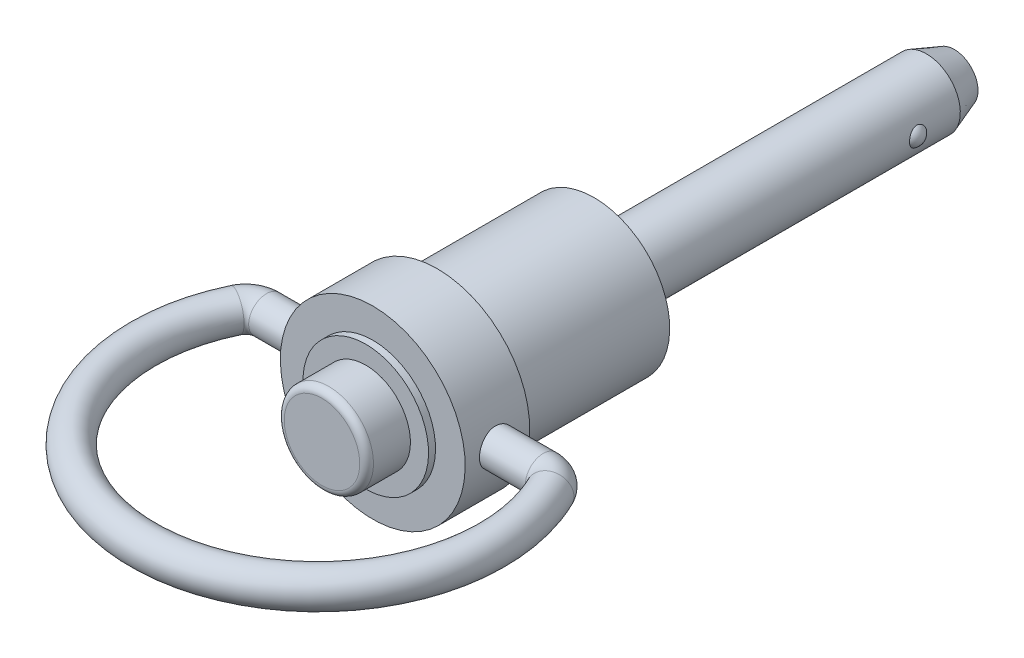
ISO-10303-21;
HEADER;
FILE_DESCRIPTION(('STEP AP214'),'2;1');
FILE_NAME('part.step','',(''),(''),'','','');
FILE_SCHEMA(('AUTOMOTIVE_DESIGN { 1 0 10303 214 1 1 1 1 }'));
ENDSEC;
DATA;
#1=APPLICATION_CONTEXT('core data for automotive mechanical design processes');
#2=APPLICATION_PROTOCOL_DEFINITION('international standard','automotive_design',2000,#1);
#3=PRODUCT_CONTEXT('',#1,'mechanical');
#4=PRODUCT('Part','Part','',(#3));
#5=PRODUCT_RELATED_PRODUCT_CATEGORY('part','',(#4));
#6=PRODUCT_DEFINITION_FORMATION('','',#4);
#7=PRODUCT_DEFINITION_CONTEXT('part definition',#1,'design');
#8=PRODUCT_DEFINITION('design','',#6,#7);
#9=PRODUCT_DEFINITION_SHAPE('','',#8);
#10=(LENGTH_UNIT() NAMED_UNIT(*) SI_UNIT(.MILLI.,.METRE.));
#11=(NAMED_UNIT(*) PLANE_ANGLE_UNIT() SI_UNIT($,.RADIAN.));
#12=(NAMED_UNIT(*) SI_UNIT($,.STERADIAN.) SOLID_ANGLE_UNIT());
#13=UNCERTAINTY_MEASURE_WITH_UNIT(LENGTH_MEASURE(1.E-05),#10,'distance_accuracy_value','');
#14=(GEOMETRIC_REPRESENTATION_CONTEXT(3) GLOBAL_UNCERTAINTY_ASSIGNED_CONTEXT((#13)) GLOBAL_UNIT_ASSIGNED_CONTEXT((#10,
#11,#12)) REPRESENTATION_CONTEXT('',''));
#15=CARTESIAN_POINT('',(0.,0.,0.));
#16=DIRECTION('',(0.,0.,1.));
#17=DIRECTION('',(1.,0.,0.));
#18=AXIS2_PLACEMENT_3D('',#15,#16,#17);
#19=CARTESIAN_POINT('',(0.,0.,20.828));
#20=DIRECTION('',(0.,0.,-1.));
#21=DIRECTION('',(0.,1.,0.));
#22=AXIS2_PLACEMENT_3D('',#19,#20,#21);
#23=CYLINDRICAL_SURFACE('',#22,3.2512);
#24=CARTESIAN_POINT('',(0.,0.,16.637));
#25=DIRECTION('',(0.,0.,-1.));
#26=DIRECTION('',(0.,1.,0.));
#27=AXIS2_PLACEMENT_3D('',#24,#25,#26);
#28=CIRCLE('',#27,3.2512);
#29=CARTESIAN_POINT('',(0.,3.2512,16.637));
#30=VERTEX_POINT('',#29);
#31=EDGE_CURVE('E34',#30,#30,#28,.T.);
#32=ORIENTED_EDGE('',*,*,#31,.F.);
#33=EDGE_LOOP('',(#32));
#34=FACE_BOUND('',#33,.T.);
#35=CARTESIAN_POINT('',(0.,0.,19.328));
#36=DIRECTION('',(0.,0.,1.));
#37=DIRECTION('',(1.,0.,0.));
#38=AXIS2_PLACEMENT_3D('',#35,#36,#37);
#39=CIRCLE('',#38,3.2512);
#40=CARTESIAN_POINT('',(3.2512,0.,19.328));
#41=VERTEX_POINT('',#40);
#42=EDGE_CURVE('E156',#41,#41,#39,.T.);
#43=ORIENTED_EDGE('',*,*,#42,.F.);
#44=EDGE_LOOP('',(#43));
#45=FACE_BOUND('',#44,.T.);
#46=ADVANCED_FACE('F12',(#34,#45),#23,.T.);
#47=CARTESIAN_POINT('',(4.572,0.,16.637));
#48=DIRECTION('',(0.,0.,1.));
#49=DIRECTION('',(0.,-1.,0.));
#50=AXIS2_PLACEMENT_3D('',#47,#48,#49);
#51=PLANE('',#50);
#52=ORIENTED_EDGE('',*,*,#31,.T.);
#53=EDGE_LOOP('',(#52));
#54=FACE_BOUND('',#53,.T.);
#55=CARTESIAN_POINT('',(0.,0.,16.637));
#56=DIRECTION('',(0.,0.,-1.));
#57=DIRECTION('',(0.,1.,0.));
#58=AXIS2_PLACEMENT_3D('',#55,#56,#57);
#59=CIRCLE('',#58,4.572);
#60=CARTESIAN_POINT('',(0.,4.572,16.637));
#61=VERTEX_POINT('',#60);
#62=EDGE_CURVE('E39',#61,#61,#59,.T.);
#63=ORIENTED_EDGE('',*,*,#62,.F.);
#64=EDGE_LOOP('',(#63));
#65=FACE_BOUND('',#64,.T.);
#66=ADVANCED_FACE('F80',(#54,#65),#51,.T.);
#67=CARTESIAN_POINT('',(0.,0.,0.));
#68=DIRECTION('',(0.,0.,-1.));
#69=DIRECTION('',(0.,1.,0.));
#70=AXIS2_PLACEMENT_3D('',#67,#68,#69);
#71=CYLINDRICAL_SURFACE('',#70,4.572);
#72=ORIENTED_EDGE('',*,*,#62,.T.);
#73=EDGE_LOOP('',(#72));
#74=FACE_BOUND('',#73,.T.);
#75=CARTESIAN_POINT('',(0.,0.,16.129));
#76=DIRECTION('',(0.,0.,-1.));
#77=DIRECTION('',(0.,1.,0.));
#78=AXIS2_PLACEMENT_3D('',#75,#76,#77);
#79=CIRCLE('',#78,4.572);
#80=CARTESIAN_POINT('',(0.,4.572,16.129));
#81=VERTEX_POINT('',#80);
#82=EDGE_CURVE('E42',#81,#81,#79,.T.);
#83=ORIENTED_EDGE('',*,*,#82,.F.);
#84=EDGE_LOOP('',(#83));
#85=FACE_BOUND('',#84,.T.);
#86=ADVANCED_FACE('F150',(#74,#85),#71,.T.);
#87=CARTESIAN_POINT('',(6.731,0.,16.129));
#88=DIRECTION('',(0.,0.,1.));
#89=DIRECTION('',(0.,-1.,0.));
#90=AXIS2_PLACEMENT_3D('',#87,#88,#89);
#91=PLANE('',#90);
#92=CARTESIAN_POINT('',(0.,0.,16.129));
#93=DIRECTION('',(0.,0.,-1.));
#94=DIRECTION('',(0.,1.,0.));
#95=AXIS2_PLACEMENT_3D('',#92,#93,#94);
#96=CIRCLE('',#95,6.731);
#97=CARTESIAN_POINT('',(0.,6.731,16.129));
#98=VERTEX_POINT('',#97);
#99=EDGE_CURVE('E45',#98,#98,#96,.T.);
#100=ORIENTED_EDGE('',*,*,#99,.F.);
#101=EDGE_LOOP('',(#100));
#102=FACE_BOUND('',#101,.T.);
#103=ORIENTED_EDGE('',*,*,#82,.T.);
#104=EDGE_LOOP('',(#103));
#105=FACE_BOUND('',#104,.T.);
#106=ADVANCED_FACE('F193',(#102,#105),#91,.T.);
#107=CARTESIAN_POINT('',(0.,0.,0.));
#108=DIRECTION('',(0.,0.,-1.));
#109=DIRECTION('',(0.,1.,0.));
#110=AXIS2_PLACEMENT_3D('',#107,#108,#109);
#111=CYLINDRICAL_SURFACE('',#110,6.731);
#112=CARTESIAN_POINT('',(0.,0.,11.43));
#113=DIRECTION('',(0.,0.,-1.));
#114=DIRECTION('',(0.,1.,0.));
#115=AXIS2_PLACEMENT_3D('',#112,#113,#114);
#116=CIRCLE('',#115,6.731);
#117=CARTESIAN_POINT('',(0.,6.731,11.43));
#118=VERTEX_POINT('',#117);
#119=EDGE_CURVE('E33',#118,#118,#116,.T.);
#120=ORIENTED_EDGE('',*,*,#119,.F.);
#121=EDGE_LOOP('',(#120));
#122=FACE_BOUND('',#121,.T.);
#123=ORIENTED_EDGE('',*,*,#99,.T.);
#124=EDGE_LOOP('',(#123));
#125=FACE_BOUND('',#124,.T.);
#126=CARTESIAN_POINT('',(-6.6051722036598,1.2954,13.7922));
#127=CARTESIAN_POINT('',(-6.60517361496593,1.2953972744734,13.864236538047));
#128=CARTESIAN_POINT('',(-6.60636346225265,1.28937073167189,13.9363080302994));
#129=CARTESIAN_POINT('',(-6.61098794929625,1.26544153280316,14.0784162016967));
#130=CARTESIAN_POINT('',(-6.61442445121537,1.24752902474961,14.1484511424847));
#131=CARTESIAN_POINT('',(-6.62313895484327,1.20040052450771,14.2844095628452));
#132=CARTESIAN_POINT('',(-6.62841519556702,1.17119533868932,14.3503369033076));
#133=CARTESIAN_POINT('',(-6.64021258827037,1.10233951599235,14.4763528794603));
#134=CARTESIAN_POINT('',(-6.64673365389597,1.06268960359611,14.5364419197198));
#135=CARTESIAN_POINT('',(-6.66038139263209,0.973516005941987,14.6498669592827));
#136=CARTESIAN_POINT('',(-6.66751428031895,0.9238817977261,14.7031153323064));
#137=CARTESIAN_POINT('',(-6.68152715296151,0.816387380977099,14.8005834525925));
#138=CARTESIAN_POINT('',(-6.6884071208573,0.758526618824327,14.8448025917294));
#139=CARTESIAN_POINT('',(-6.7012057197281,0.635644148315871,14.9232944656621));
#140=CARTESIAN_POINT('',(-6.70711617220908,0.570568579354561,14.9574843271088));
#141=CARTESIAN_POINT('',(-6.71724013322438,0.435464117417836,15.014412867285));
#142=CARTESIAN_POINT('',(-6.72145378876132,0.365435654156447,15.0371525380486));
#143=CARTESIAN_POINT('',(-6.72766549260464,0.223321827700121,15.0702635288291));
#144=CARTESIAN_POINT('',(-6.72968999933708,0.151272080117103,15.0807826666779));
#145=CARTESIAN_POINT('',(-6.73138656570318,0.00640388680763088,15.089614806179));
#146=CARTESIAN_POINT('',(-6.73105883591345,-0.0664144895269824,15.0879289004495));
#147=CARTESIAN_POINT('',(-6.72810846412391,-0.209738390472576,15.072511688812));
#148=CARTESIAN_POINT('',(-6.72551615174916,-0.280261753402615,15.0589395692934));
#149=CARTESIAN_POINT('',(-6.71836197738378,-0.418011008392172,15.0203872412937));
#150=CARTESIAN_POINT('',(-6.71380004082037,-0.485236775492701,14.9954066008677));
#151=CARTESIAN_POINT('',(-6.70316878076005,-0.614941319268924,14.9345963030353));
#152=CARTESIAN_POINT('',(-6.69709072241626,-0.67738974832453,14.8987035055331));
#153=CARTESIAN_POINT('',(-6.68409856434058,-0.795436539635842,14.8171343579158));
#154=CARTESIAN_POINT('',(-6.677184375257,-0.851034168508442,14.7714569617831));
#155=CARTESIAN_POINT('',(-6.66315320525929,-0.954744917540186,14.6707395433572));
#156=CARTESIAN_POINT('',(-6.65603475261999,-1.00272266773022,14.6155602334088));
#157=CARTESIAN_POINT('',(-6.64250376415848,-1.08876420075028,14.4978679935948));
#158=CARTESIAN_POINT('',(-6.63609123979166,-1.12682782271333,14.4353549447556));
#159=CARTESIAN_POINT('',(-6.62469571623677,-1.19200234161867,14.3045844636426));
#160=CARTESIAN_POINT('',(-6.61971540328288,-1.21909269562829,14.2363165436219));
#161=CARTESIAN_POINT('',(-6.61178862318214,-1.26138008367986,14.0960804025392));
#162=CARTESIAN_POINT('',(-6.60884191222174,-1.27657854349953,14.0241126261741));
#163=CARTESIAN_POINT('',(-6.60536444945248,-1.29445125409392,13.8797427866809));
#164=CARTESIAN_POINT('',(-6.60479610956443,-1.29732037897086,13.8073657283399));
#165=CARTESIAN_POINT('',(-6.60603903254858,-1.29097613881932,13.6631669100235));
#166=CARTESIAN_POINT('',(-6.60785017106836,-1.28176340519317,13.5913451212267));
#167=CARTESIAN_POINT('',(-6.6136128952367,-1.25168453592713,13.4509418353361));
#168=CARTESIAN_POINT('',(-6.61754556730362,-1.23092132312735,13.3823374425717));
#169=CARTESIAN_POINT('',(-6.62709183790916,-1.17844042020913,13.249581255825));
#170=CARTESIAN_POINT('',(-6.63270556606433,-1.14672188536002,13.1854298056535));
#171=CARTESIAN_POINT('',(-6.6450665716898,-1.07278507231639,13.0625442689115));
#172=CARTESIAN_POINT('',(-6.65182676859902,-1.03044414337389,13.0038853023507));
#173=CARTESIAN_POINT('',(-6.66568301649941,-0.936629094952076,12.8944341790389));
#174=CARTESIAN_POINT('',(-6.67277909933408,-0.885154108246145,12.8436427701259));
#175=CARTESIAN_POINT('',(-6.68662882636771,-0.773660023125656,12.7506362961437));
#176=CARTESIAN_POINT('',(-6.69337621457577,-0.713530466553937,12.7085525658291));
#177=CARTESIAN_POINT('',(-6.70566168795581,-0.586941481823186,12.6350847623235));
#178=CARTESIAN_POINT('',(-6.71119982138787,-0.520482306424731,12.6037002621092));
#179=CARTESIAN_POINT('',(-6.72041595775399,-0.383476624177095,12.5527164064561));
#180=CARTESIAN_POINT('',(-6.72410395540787,-0.312954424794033,12.5330536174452));
#181=CARTESIAN_POINT('',(-6.72924701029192,-0.169530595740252,12.5058694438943));
#182=CARTESIAN_POINT('',(-6.7307023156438,-0.0966292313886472,12.4983467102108));
#183=CARTESIAN_POINT('',(-6.73121071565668,0.0482259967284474,12.4957052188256));
#184=CARTESIAN_POINT('',(-6.73030215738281,0.120176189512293,12.5003884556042));
#185=CARTESIAN_POINT('',(-6.72626496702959,0.26224403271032,12.5215909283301));
#186=CARTESIAN_POINT('',(-6.72313635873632,0.332361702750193,12.5381100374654));
#187=CARTESIAN_POINT('',(-6.71501101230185,0.468662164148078,12.5824301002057));
#188=CARTESIAN_POINT('',(-6.710017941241,0.534852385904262,12.6102089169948));
#189=CARTESIAN_POINT('',(-6.69870305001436,0.661661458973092,12.6762356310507));
#190=CARTESIAN_POINT('',(-6.69238113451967,0.722279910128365,12.7144842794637));
#191=CARTESIAN_POINT('',(-6.6789853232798,0.837208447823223,12.8010411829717));
#192=CARTESIAN_POINT('',(-6.67190155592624,0.891410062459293,12.8494919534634));
#193=CARTESIAN_POINT('',(-6.65784127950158,0.990982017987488,12.95478313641));
#194=CARTESIAN_POINT('',(-6.65086479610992,1.03635027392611,13.0116255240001));
#195=CARTESIAN_POINT('',(-6.63773378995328,1.11738877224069,13.1327559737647));
#196=CARTESIAN_POINT('',(-6.63158802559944,1.15295925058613,13.1971117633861));
#197=CARTESIAN_POINT('',(-6.62092027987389,1.21272619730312,13.3309847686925));
#198=CARTESIAN_POINT('',(-6.61639678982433,1.23693323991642,13.4004971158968));
#199=CARTESIAN_POINT('',(-6.61041337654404,1.26845390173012,13.5238636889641));
#200=CARTESIAN_POINT('',(-6.60845980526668,1.27854107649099,13.57700269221));
#201=CARTESIAN_POINT('',(-6.60583870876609,1.29201504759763,13.6841545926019));
#202=CARTESIAN_POINT('',(-6.60517114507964,1.29540204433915,13.7381674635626));
#203=CARTESIAN_POINT('',(-6.6051722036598,1.2954,13.7922));
#204=B_SPLINE_CURVE_WITH_KNOTS('',3,(#126,#127,#128,#129,#130,#131,#132,#133,#134,#135,#136,
#137,#138,#139,#140,#141,#142,#143,#144,#145,#146,#147,#148,#149,#150,#151,#152,#153,#154,#155,
#156,#157,#158,#159,#160,#161,#162,#163,#164,#165,#166,#167,#168,#169,#170,#171,#172,#173,#174,
#175,#176,#177,#178,#179,#180,#181,#182,#183,#184,#185,#186,#187,#188,#189,#190,#191,#192,#193,
#194,#195,#196,#197,#198,#199,#200,#201,#202,#203),.UNSPECIFIED.,.T.,.F.,(4,2,2,2,2,2,2,2,2,2,2,
2,2,2,2,2,2,2,2,2,2,2,2,2,2,2,2,2,2,2,2,2,2,2,2,2,2,2,4),(0.,0.215911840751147,
0.432002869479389,0.64788762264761,0.86375740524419,1.08216318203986,1.30058366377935,
1.52076118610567,1.74091962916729,1.95838638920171,2.1758336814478,2.39041258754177,
2.60499961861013,2.82085272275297,3.0367289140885,3.25609136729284,3.47545737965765,
3.69523218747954,3.91498064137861,4.13124273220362,4.34749352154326,4.56184753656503,
4.7762180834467,4.99318797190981,5.21017847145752,5.430235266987,5.65028327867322,
5.86912939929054,6.08795119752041,6.30324544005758,6.51853737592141,6.73340808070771,
6.94829420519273,7.16640910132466,7.38457541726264,7.60488731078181,7.82499378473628,
7.9869478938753,8.14889715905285),.UNSPECIFIED.);
#205=CARTESIAN_POINT('',(-6.6051722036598,1.2954,13.7922));
#206=VERTEX_POINT('',#205);
#207=EDGE_CURVE('E27',#206,#206,#204,.T.);
#208=ORIENTED_EDGE('',*,*,#207,.T.);
#209=EDGE_LOOP('',(#208));
#210=FACE_BOUND('',#209,.T.);
#211=CARTESIAN_POINT('',(6.6051722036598,1.2954,13.7922));
#212=CARTESIAN_POINT('',(6.60517361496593,1.2953972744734,13.720163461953));
#213=CARTESIAN_POINT('',(6.60636346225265,1.2893707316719,13.6480919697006));
#214=CARTESIAN_POINT('',(6.61098794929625,1.26544153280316,13.5059837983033));
#215=CARTESIAN_POINT('',(6.61442445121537,1.24752902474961,13.4359488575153));
#216=CARTESIAN_POINT('',(6.62313895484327,1.20040052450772,13.2999904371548));
#217=CARTESIAN_POINT('',(6.62841519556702,1.17119533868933,13.2340630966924));
#218=CARTESIAN_POINT('',(6.64021258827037,1.10233951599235,13.1080471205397));
#219=CARTESIAN_POINT('',(6.64673365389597,1.06268960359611,13.0479580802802));
#220=CARTESIAN_POINT('',(6.66038139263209,0.973516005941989,12.9345330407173));
#221=CARTESIAN_POINT('',(6.66751428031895,0.923881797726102,12.8812846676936));
#222=CARTESIAN_POINT('',(6.68152715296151,0.816387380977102,12.7838165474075));
#223=CARTESIAN_POINT('',(6.6884071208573,0.758526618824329,12.7395974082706));
#224=CARTESIAN_POINT('',(6.7012057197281,0.635644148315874,12.6611055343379));
#225=CARTESIAN_POINT('',(6.70711617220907,0.570568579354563,12.6269156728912));
#226=CARTESIAN_POINT('',(6.71724013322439,0.435464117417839,12.569987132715));
#227=CARTESIAN_POINT('',(6.72145378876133,0.36543565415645,12.5472474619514));
#228=CARTESIAN_POINT('',(6.72766549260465,0.223321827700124,12.5141364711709));
#229=CARTESIAN_POINT('',(6.72968999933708,0.151272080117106,12.5036173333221));
#230=CARTESIAN_POINT('',(6.73138656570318,0.00640388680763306,12.494785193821));
#231=CARTESIAN_POINT('',(6.73105883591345,-0.0664144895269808,12.4964710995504));
#232=CARTESIAN_POINT('',(6.72810846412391,-0.209738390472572,12.511888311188));
#233=CARTESIAN_POINT('',(6.72551615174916,-0.280261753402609,12.5254604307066));
#234=CARTESIAN_POINT('',(6.71836197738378,-0.418011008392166,12.5640127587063));
#235=CARTESIAN_POINT('',(6.71380004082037,-0.4852367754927,12.5889933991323));
#236=CARTESIAN_POINT('',(6.70316878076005,-0.614941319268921,12.6498036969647));
#237=CARTESIAN_POINT('',(6.69709072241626,-0.67738974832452,12.6856964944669));
#238=CARTESIAN_POINT('',(6.68409856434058,-0.795436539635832,12.7672656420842));
#239=CARTESIAN_POINT('',(6.677184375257,-0.851034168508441,12.8129430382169));
#240=CARTESIAN_POINT('',(6.66315320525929,-0.954744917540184,12.9136604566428));
#241=CARTESIAN_POINT('',(6.65603475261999,-1.00272266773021,12.9688397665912));
#242=CARTESIAN_POINT('',(6.64250376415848,-1.08876420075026,13.0865320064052));
#243=CARTESIAN_POINT('',(6.63609123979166,-1.12682782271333,13.1490450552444));
#244=CARTESIAN_POINT('',(6.62469571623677,-1.19200234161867,13.2798155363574));
#245=CARTESIAN_POINT('',(6.61971540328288,-1.21909269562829,13.3480834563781));
#246=CARTESIAN_POINT('',(6.61178862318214,-1.26138008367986,13.4883195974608));
#247=CARTESIAN_POINT('',(6.60884191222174,-1.27657854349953,13.5602873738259));
#248=CARTESIAN_POINT('',(6.60536444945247,-1.29445125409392,13.7046572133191));
#249=CARTESIAN_POINT('',(6.60479610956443,-1.29732037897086,13.7770342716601));
#250=CARTESIAN_POINT('',(6.60603903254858,-1.29097613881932,13.9212330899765));
#251=CARTESIAN_POINT('',(6.60785017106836,-1.28176340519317,13.9930548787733));
#252=CARTESIAN_POINT('',(6.6136128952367,-1.25168453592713,14.1334581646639));
#253=CARTESIAN_POINT('',(6.61754556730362,-1.23092132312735,14.2020625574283));
#254=CARTESIAN_POINT('',(6.62709183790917,-1.17844042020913,14.334818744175));
#255=CARTESIAN_POINT('',(6.63270556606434,-1.14672188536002,14.3989701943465));
#256=CARTESIAN_POINT('',(6.64506657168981,-1.07278507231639,14.5218557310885));
#257=CARTESIAN_POINT('',(6.65182676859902,-1.03044414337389,14.5805146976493));
#258=CARTESIAN_POINT('',(6.66568301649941,-0.936629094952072,14.6899658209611));
#259=CARTESIAN_POINT('',(6.67277909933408,-0.885154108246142,14.7407572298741));
#260=CARTESIAN_POINT('',(6.68662882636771,-0.773660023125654,14.8337637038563));
#261=CARTESIAN_POINT('',(6.69337621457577,-0.713530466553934,14.8758474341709));
#262=CARTESIAN_POINT('',(6.70566168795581,-0.586941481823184,14.9493152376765));
#263=CARTESIAN_POINT('',(6.71119982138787,-0.520482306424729,14.9806997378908));
#264=CARTESIAN_POINT('',(6.72041595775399,-0.383476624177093,15.0316835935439));
#265=CARTESIAN_POINT('',(6.72410395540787,-0.31295442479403,15.0513463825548));
#266=CARTESIAN_POINT('',(6.72924701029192,-0.169530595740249,15.0785305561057));
#267=CARTESIAN_POINT('',(6.7307023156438,-0.0966292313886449,15.0860532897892));
#268=CARTESIAN_POINT('',(6.73121071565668,0.0482259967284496,15.0886947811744));
#269=CARTESIAN_POINT('',(6.73030215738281,0.120176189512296,15.0840115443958));
#270=CARTESIAN_POINT('',(6.72626496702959,0.262244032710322,15.0628090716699));
#271=CARTESIAN_POINT('',(6.72313635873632,0.332361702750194,15.0462899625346));
#272=CARTESIAN_POINT('',(6.71501101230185,0.46866216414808,15.0019698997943));
#273=CARTESIAN_POINT('',(6.710017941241,0.534852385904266,14.9741910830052));
#274=CARTESIAN_POINT('',(6.69870305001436,0.661661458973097,14.9081643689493));
#275=CARTESIAN_POINT('',(6.69238113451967,0.722279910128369,14.8699157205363));
#276=CARTESIAN_POINT('',(6.6789853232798,0.837208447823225,14.7833588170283));
#277=CARTESIAN_POINT('',(6.67190155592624,0.891410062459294,14.7349080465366));
#278=CARTESIAN_POINT('',(6.65784127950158,0.990982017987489,14.62961686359));
#279=CARTESIAN_POINT('',(6.65086479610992,1.03635027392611,14.5727744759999));
#280=CARTESIAN_POINT('',(6.63773378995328,1.1173887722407,14.4516440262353));
#281=CARTESIAN_POINT('',(6.63158802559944,1.15295925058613,14.3872882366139));
#282=CARTESIAN_POINT('',(6.62092027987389,1.21272619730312,14.2534152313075));
#283=CARTESIAN_POINT('',(6.61639678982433,1.23693323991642,14.1839028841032));
#284=CARTESIAN_POINT('',(6.61041337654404,1.26845390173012,14.0605363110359));
#285=CARTESIAN_POINT('',(6.60845980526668,1.27854107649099,14.00739730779));
#286=CARTESIAN_POINT('',(6.60583870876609,1.29201504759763,13.9002454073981));
#287=CARTESIAN_POINT('',(6.60517114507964,1.29540204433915,13.8462325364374));
#288=CARTESIAN_POINT('',(6.6051722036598,1.2954,13.7922));
#289=B_SPLINE_CURVE_WITH_KNOTS('',3,(#211,#212,#213,#214,#215,#216,#217,#218,#219,#220,#221,
#222,#223,#224,#225,#226,#227,#228,#229,#230,#231,#232,#233,#234,#235,#236,#237,#238,#239,#240,
#241,#242,#243,#244,#245,#246,#247,#248,#249,#250,#251,#252,#253,#254,#255,#256,#257,#258,#259,
#260,#261,#262,#263,#264,#265,#266,#267,#268,#269,#270,#271,#272,#273,#274,#275,#276,#277,#278,
#279,#280,#281,#282,#283,#284,#285,#286,#287,#288),.UNSPECIFIED.,.T.,.F.,(4,2,2,2,2,2,2,2,2,2,2,
2,2,2,2,2,2,2,2,2,2,2,2,2,2,2,2,2,2,2,2,2,2,2,2,2,2,2,4),(0.,0.215911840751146,
0.432002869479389,0.64788762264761,0.86375740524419,1.08216318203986,1.30058366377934,
1.52076118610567,1.74091962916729,1.95838638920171,2.1758336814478,2.39041258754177,
2.60499961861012,2.82085272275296,3.0367289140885,3.25609136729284,3.47545737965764,
3.69523218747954,3.91498064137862,4.13124273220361,4.34749352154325,4.56184753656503,
4.77621808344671,4.99318797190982,5.21017847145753,5.43023526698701,5.65028327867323,
5.86912939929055,6.08795119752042,6.30324544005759,6.51853737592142,6.73340808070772,
6.94829420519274,7.16640910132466,7.38457541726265,7.60488731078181,7.82499378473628,
7.98694789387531,8.14889715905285),.UNSPECIFIED.);
#290=CARTESIAN_POINT('',(6.6051722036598,1.2954,13.7922));
#291=VERTEX_POINT('',#290);
#292=EDGE_CURVE('E23',#291,#291,#289,.T.);
#293=ORIENTED_EDGE('',*,*,#292,.T.);
#294=EDGE_LOOP('',(#293));
#295=FACE_BOUND('',#294,.T.);
#296=ADVANCED_FACE('F142',(#122,#125,#210,#295),#111,.T.);
#297=CARTESIAN_POINT('',(5.7785,0.,11.43));
#298=DIRECTION('',(0.,0.,-1.));
#299=DIRECTION('',(0.,1.,0.));
#300=AXIS2_PLACEMENT_3D('',#297,#298,#299);
#301=PLANE('',#300);
#302=CARTESIAN_POINT('',(0.,0.,11.43));
#303=DIRECTION('',(0.,0.,-1.));
#304=DIRECTION('',(0.,1.,0.));
#305=AXIS2_PLACEMENT_3D('',#302,#303,#304);
#306=CIRCLE('',#305,5.9);
#307=CARTESIAN_POINT('',(0.,5.9,11.43));
#308=VERTEX_POINT('',#307);
#309=EDGE_CURVE('E19',#308,#308,#306,.F.);
#310=ORIENTED_EDGE('',*,*,#309,.T.);
#311=EDGE_LOOP('',(#310));
#312=FACE_BOUND('',#311,.T.);
#313=ORIENTED_EDGE('',*,*,#119,.T.);
#314=EDGE_LOOP('',(#313));
#315=FACE_BOUND('',#314,.T.);
#316=ADVANCED_FACE('F136',(#312,#315),#301,.T.);
#317=CARTESIAN_POINT('',(10.0803124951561,0.,15.3162));
#318=DIRECTION('',(0.,1.,0.));
#319=DIRECTION('',(-1.,0.,0.));
#320=AXIS2_PLACEMENT_3D('',#317,#318,#319);
#321=TOROIDAL_SURFACE('',#320,1.524,1.2954);
#322=CARTESIAN_POINT('',(11.4549005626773,0.,14.658109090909));
#323=DIRECTION('',(-0.431818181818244,0.,-0.901960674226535));
#324=DIRECTION('',(0.901960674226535,0.,-0.431818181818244));
#325=AXIS2_PLACEMENT_3D('',#322,#323,#324);
#326=CIRCLE('',#325,1.2954);
#327=CARTESIAN_POINT('',(12.6233004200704,0.,14.0987318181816));
#328=VERTEX_POINT('',#327);
#329=EDGE_CURVE('E50',#328,#328,#326,.T.);
#330=ORIENTED_EDGE('',*,*,#329,.T.);
#331=EDGE_LOOP('',(#330));
#332=FACE_BOUND('',#331,.T.);
#333=CARTESIAN_POINT('',(10.0803124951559,0.,13.7922));
#334=DIRECTION('',(1.,0.,0.));
#335=DIRECTION('',(0.,1.,0.));
#336=AXIS2_PLACEMENT_3D('',#333,#334,#335);
#337=CIRCLE('',#336,1.2954);
#338=CARTESIAN_POINT('',(10.0803124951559,1.2954,13.7922));
#339=VERTEX_POINT('',#338);
#340=EDGE_CURVE('E38',#339,#339,#337,.F.);
#341=ORIENTED_EDGE('',*,*,#340,.F.);
#342=EDGE_LOOP('',(#341));
#343=FACE_BOUND('',#342,.T.);
#344=ADVANCED_FACE('F78',(#332,#343),#321,.T.);
#345=CARTESIAN_POINT('',(-10.0803124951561,0.,13.7922));
#346=DIRECTION('',(1.,0.,0.));
#347=DIRECTION('',(0.,1.,0.));
#348=AXIS2_PLACEMENT_3D('',#345,#346,#347);
#349=CYLINDRICAL_SURFACE('',#348,1.2954);
#350=ORIENTED_EDGE('',*,*,#292,.F.);
#351=EDGE_LOOP('',(#350));
#352=FACE_BOUND('',#351,.T.);
#353=ORIENTED_EDGE('',*,*,#340,.T.);
#354=EDGE_LOOP('',(#353));
#355=FACE_BOUND('',#354,.T.);
#356=ADVANCED_FACE('F74',(#352,#355),#349,.T.);
#357=CARTESIAN_POINT('',(0.,0.,20.1422));
#358=DIRECTION('',(0.,1.,0.));
#359=DIRECTION('',(-1.,0.,0.));
#360=AXIS2_PLACEMENT_3D('',#357,#358,#359);
#361=TOROIDAL_SURFACE('',#360,12.7,1.2954);
#362=CARTESIAN_POINT('',(-11.4549005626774,0.,14.6581090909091));
#363=DIRECTION('',(-0.43181818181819,0.,0.901960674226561));
#364=DIRECTION('',(-0.901960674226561,0.,-0.43181818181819));
#365=AXIS2_PLACEMENT_3D('',#362,#363,#364);
#366=CIRCLE('',#365,1.2954);
#367=CARTESIAN_POINT('',(-12.6233004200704,0.,14.0987318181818));
#368=VERTEX_POINT('',#367);
#369=EDGE_CURVE('E53',#368,#368,#366,.F.);
#370=ORIENTED_EDGE('',*,*,#369,.F.);
#371=EDGE_LOOP('',(#370));
#372=FACE_BOUND('',#371,.T.);
#373=ORIENTED_EDGE('',*,*,#329,.F.);
#374=EDGE_LOOP('',(#373));
#375=FACE_BOUND('',#374,.T.);
#376=ADVANCED_FACE('F71',(#372,#375),#361,.T.);
#377=CARTESIAN_POINT('',(-10.0803124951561,0.,15.3162));
#378=DIRECTION('',(0.,1.,0.));
#379=DIRECTION('',(-1.,0.,0.));
#380=AXIS2_PLACEMENT_3D('',#377,#378,#379);
#381=TOROIDAL_SURFACE('',#380,1.524,1.2954);
#382=CARTESIAN_POINT('',(-10.0803124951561,0.,13.7922));
#383=DIRECTION('',(1.,0.,0.));
#384=DIRECTION('',(0.,1.,0.));
#385=AXIS2_PLACEMENT_3D('',#382,#383,#384);
#386=CIRCLE('',#385,1.2954);
#387=CARTESIAN_POINT('',(-10.0803124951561,1.2954,13.7922));
#388=VERTEX_POINT('',#387);
#389=EDGE_CURVE('E37',#388,#388,#386,.T.);
#390=ORIENTED_EDGE('',*,*,#389,.F.);
#391=EDGE_LOOP('',(#390));
#392=FACE_BOUND('',#391,.T.);
#393=ORIENTED_EDGE('',*,*,#369,.T.);
#394=EDGE_LOOP('',(#393));
#395=FACE_BOUND('',#394,.T.);
#396=ADVANCED_FACE('F66',(#392,#395),#381,.T.);
#397=CARTESIAN_POINT('',(-10.0803124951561,0.,13.7922));
#398=DIRECTION('',(1.,0.,0.));
#399=DIRECTION('',(0.,1.,0.));
#400=AXIS2_PLACEMENT_3D('',#397,#398,#399);
#401=CYLINDRICAL_SURFACE('',#400,1.2954);
#402=ORIENTED_EDGE('',*,*,#207,.F.);
#403=EDGE_LOOP('',(#402));
#404=FACE_BOUND('',#403,.T.);
#405=ORIENTED_EDGE('',*,*,#389,.T.);
#406=EDGE_LOOP('',(#405));
#407=FACE_BOUND('',#406,.T.);
#408=ADVANCED_FACE('F70',(#404,#407),#401,.T.);
#409=CARTESIAN_POINT('',(0.,0.,19.328));
#410=DIRECTION('',(0.,0.,1.));
#411=DIRECTION('',(1.,0.,0.));
#412=AXIS2_PLACEMENT_3D('',#409,#410,#411);
#413=TOROIDAL_SURFACE('',#412,2.7512,0.5);
#414=CARTESIAN_POINT('',(0.,0.,19.828));
#415=DIRECTION('',(0.,0.,1.));
#416=DIRECTION('',(1.,0.,0.));
#417=AXIS2_PLACEMENT_3D('',#414,#415,#416);
#418=CIRCLE('',#417,2.7512);
#419=CARTESIAN_POINT('',(2.7512,0.,19.828));
#420=VERTEX_POINT('',#419);
#421=EDGE_CURVE('E158',#420,#420,#418,.T.);
#422=ORIENTED_EDGE('',*,*,#421,.F.);
#423=EDGE_LOOP('',(#422));
#424=FACE_BOUND('',#423,.T.);
#425=ORIENTED_EDGE('',*,*,#42,.T.);
#426=EDGE_LOOP('',(#425));
#427=FACE_BOUND('',#426,.T.);
#428=ADVANCED_FACE('F97',(#424,#427),#413,.T.);
#429=CARTESIAN_POINT('',(0.,0.,19.828));
#430=DIRECTION('',(0.,0.,-1.));
#431=DIRECTION('',(-1.,0.,0.));
#432=AXIS2_PLACEMENT_3D('',#429,#430,#431);
#433=PLANE('',#432);
#434=ORIENTED_EDGE('',*,*,#421,.T.);
#435=EDGE_LOOP('',(#434));
#436=FACE_BOUND('',#435,.T.);
#437=ADVANCED_FACE('F170',(#436),#433,.F.);
#438=CARTESIAN_POINT('',(0.,0.,42.1857590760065));
#439=DIRECTION('',(0.,0.,-1.));
#440=DIRECTION('',(0.,1.,0.));
#441=AXIS2_PLACEMENT_3D('',#438,#439,#440);
#442=CYLINDRICAL_SURFACE('',#441,5.5);
#443=CARTESIAN_POINT('',(0.,0.,11.03));
#444=DIRECTION('',(0.,0.,-1.));
#445=DIRECTION('',(0.,1.,0.));
#446=AXIS2_PLACEMENT_3D('',#443,#444,#445);
#447=CIRCLE('',#446,5.5);
#448=CARTESIAN_POINT('',(0.,5.5,11.03));
#449=VERTEX_POINT('',#448);
#450=EDGE_CURVE('E8',#449,#449,#447,.T.);
#451=ORIENTED_EDGE('',*,*,#450,.T.);
#452=EDGE_LOOP('',(#451));
#453=FACE_BOUND('',#452,.T.);
#454=CARTESIAN_POINT('',(0.,0.,0.));
#455=DIRECTION('',(0.,0.,-1.));
#456=DIRECTION('',(0.,1.,0.));
#457=AXIS2_PLACEMENT_3D('',#454,#455,#456);
#458=CIRCLE('',#457,5.5);
#459=CARTESIAN_POINT('',(0.,5.5,0.));
#460=VERTEX_POINT('',#459);
#461=EDGE_CURVE('E161',#460,#460,#458,.T.);
#462=ORIENTED_EDGE('',*,*,#461,.F.);
#463=EDGE_LOOP('',(#462));
#464=FACE_BOUND('',#463,.T.);
#465=ADVANCED_FACE('F104',(#453,#464),#442,.T.);
#466=CARTESIAN_POINT('',(1.73119748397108,0.,-26.2306));
#467=DIRECTION('',(0.,0.,1.));
#468=DIRECTION('',(0.,-1.,0.));
#469=AXIS2_PLACEMENT_3D('',#466,#467,#468);
#470=PLANE('',#469);
#471=CARTESIAN_POINT('',(0.,0.,-26.2306000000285));
#472=DIRECTION('',(0.,0.,1.));
#473=DIRECTION('',(-1.,0.,0.));
#474=AXIS2_PLACEMENT_3D('',#471,#472,#473);
#475=CIRCLE('',#474,1.73119748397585);
#476=CARTESIAN_POINT('',(-1.73119748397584,0.,-26.2306000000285));
#477=VERTEX_POINT('',#476);
#478=EDGE_CURVE('E123',#477,#477,#475,.T.);
#479=ORIENTED_EDGE('',*,*,#478,.F.);
#480=EDGE_LOOP('',(#479));
#481=FACE_BOUND('',#480,.T.);
#482=ADVANCED_FACE('F99',(#481),#470,.F.);
#483=CARTESIAN_POINT('',(1.97739,0.,-21.1252));
#484=DIRECTION('',(0.,0.,1.));
#485=DIRECTION('',(1.,0.,0.));
#486=AXIS2_PLACEMENT_3D('',#483,#484,#485);
#487=SPHERICAL_SURFACE('',#486,0.79375);
#488=CARTESIAN_POINT('',(2.470785,0.,-20.5034279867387));
#489=CARTESIAN_POINT('',(2.47078450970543,0.0407779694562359,-20.5034284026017));
#490=CARTESIAN_POINT('',(2.46976664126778,0.0815627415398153,-20.5066414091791));
#491=CARTESIAN_POINT('',(2.46579298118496,0.162087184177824,-20.5194782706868));
#492=CARTESIAN_POINT('',(2.46283382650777,0.20182491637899,-20.5291132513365));
#493=CARTESIAN_POINT('',(2.45527981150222,0.279082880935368,-20.5547224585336));
#494=CARTESIAN_POINT('',(2.45068366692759,0.316601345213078,-20.5707016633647));
#495=CARTESIAN_POINT('',(2.44036557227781,0.38820458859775,-20.6088086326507));
#496=CARTESIAN_POINT('',(2.43464406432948,0.422290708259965,-20.6309339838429));
#497=CARTESIAN_POINT('',(2.42293774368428,0.484910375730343,-20.6802681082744));
#498=CARTESIAN_POINT('',(2.41696529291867,0.513575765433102,-20.7073117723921));
#499=CARTESIAN_POINT('',(2.40537490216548,0.56538165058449,-20.7663344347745));
#500=CARTESIAN_POINT('',(2.39975676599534,0.588525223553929,-20.7983106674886));
#501=CARTESIAN_POINT('',(2.39013715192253,0.626395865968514,-20.8632598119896));
#502=CARTESIAN_POINT('',(2.38603581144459,0.641692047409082,-20.8958854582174));
#503=CARTESIAN_POINT('',(2.37935105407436,0.666054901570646,-20.9635277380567));
#504=CARTESIAN_POINT('',(2.37676637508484,0.675126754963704,-20.9985423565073));
#505=CARTESIAN_POINT('',(2.37365169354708,0.685991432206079,-21.0661524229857));
#506=CARTESIAN_POINT('',(2.37294150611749,0.688423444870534,-21.0986379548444));
#507=CARTESIAN_POINT('',(2.37313557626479,0.687754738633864,-21.1635427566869));
#508=CARTESIAN_POINT('',(2.37403937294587,0.684655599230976,-21.1959620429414));
#509=CARTESIAN_POINT('',(2.37727684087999,0.673323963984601,-21.258349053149));
#510=CARTESIAN_POINT('',(2.37954686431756,0.665319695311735,-21.2883621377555));
#511=CARTESIAN_POINT('',(2.38521427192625,0.644705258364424,-21.3466434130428));
#512=CARTESIAN_POINT('',(2.38861178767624,0.632094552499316,-21.374911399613));
#513=CARTESIAN_POINT('',(2.39633342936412,0.602171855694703,-21.4300782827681));
#514=CARTESIAN_POINT('',(2.40068724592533,0.584702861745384,-21.4568875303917));
#515=CARTESIAN_POINT('',(2.40981924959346,0.545846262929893,-21.5074782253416));
#516=CARTESIAN_POINT('',(2.41459823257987,0.52445122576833,-21.5312537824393));
#517=CARTESIAN_POINT('',(2.42457469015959,0.476310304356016,-21.5773361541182));
#518=CARTESIAN_POINT('',(2.42977140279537,0.449257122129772,-21.5993219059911));
#519=CARTESIAN_POINT('',(2.43965148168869,0.392072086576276,-21.6388785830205));
#520=CARTESIAN_POINT('',(2.44433535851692,0.361943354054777,-21.6564539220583));
#521=CARTESIAN_POINT('',(2.45319212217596,0.296347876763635,-21.6884994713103));
#522=CARTESIAN_POINT('',(2.45727382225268,0.260646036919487,-21.7025143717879));
#523=CARTESIAN_POINT('',(2.4639385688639,0.187441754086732,-21.7249081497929));
#524=CARTESIAN_POINT('',(2.46652349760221,0.149941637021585,-21.7332941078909));
#525=CARTESIAN_POINT('',(2.46992655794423,0.0749487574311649,-21.7442592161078));
#526=CARTESIAN_POINT('',(2.47078545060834,0.0374772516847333,-21.7469723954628));
#527=CARTESIAN_POINT('',(2.47078450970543,-0.0407779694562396,-21.7469715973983));
#528=CARTESIAN_POINT('',(2.46976664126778,-0.0815627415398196,-21.7437585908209));
#529=CARTESIAN_POINT('',(2.46579298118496,-0.16208718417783,-21.7309217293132));
#530=CARTESIAN_POINT('',(2.46283382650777,-0.201824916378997,-21.7212867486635));
#531=CARTESIAN_POINT('',(2.45527981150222,-0.279082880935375,-21.6956775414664));
#532=CARTESIAN_POINT('',(2.45068366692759,-0.316601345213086,-21.6796983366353));
#533=CARTESIAN_POINT('',(2.44036557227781,-0.38820458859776,-21.6415913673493));
#534=CARTESIAN_POINT('',(2.43464406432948,-0.422290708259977,-21.6194660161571));
#535=CARTESIAN_POINT('',(2.42293774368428,-0.484910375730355,-21.5701318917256));
#536=CARTESIAN_POINT('',(2.41696529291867,-0.513575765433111,-21.5430882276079));
#537=CARTESIAN_POINT('',(2.40537490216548,-0.565381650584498,-21.4840655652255));
#538=CARTESIAN_POINT('',(2.39975676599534,-0.588525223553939,-21.4520893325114));
#539=CARTESIAN_POINT('',(2.39013715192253,-0.626395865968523,-21.3871401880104));
#540=CARTESIAN_POINT('',(2.38603581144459,-0.641692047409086,-21.3545145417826));
#541=CARTESIAN_POINT('',(2.37935105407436,-0.666054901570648,-21.2868722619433));
#542=CARTESIAN_POINT('',(2.37676637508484,-0.675126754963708,-21.2518576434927));
#543=CARTESIAN_POINT('',(2.37365169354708,-0.685991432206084,-21.1842475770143));
#544=CARTESIAN_POINT('',(2.37294150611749,-0.688423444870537,-21.1517620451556));
#545=CARTESIAN_POINT('',(2.37313557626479,-0.687754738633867,-21.0868572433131));
#546=CARTESIAN_POINT('',(2.37403937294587,-0.68465559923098,-21.0544379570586));
#547=CARTESIAN_POINT('',(2.37727684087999,-0.673323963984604,-20.992050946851));
#548=CARTESIAN_POINT('',(2.37954686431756,-0.665319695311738,-20.9620378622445));
#549=CARTESIAN_POINT('',(2.38521427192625,-0.644705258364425,-20.9037565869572));
#550=CARTESIAN_POINT('',(2.38861178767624,-0.632094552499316,-20.875488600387));
#551=CARTESIAN_POINT('',(2.39633342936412,-0.602171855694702,-20.8203217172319));
#552=CARTESIAN_POINT('',(2.40068724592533,-0.584702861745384,-20.7935124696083));
#553=CARTESIAN_POINT('',(2.40981924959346,-0.545846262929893,-20.7429217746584));
#554=CARTESIAN_POINT('',(2.41459823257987,-0.524451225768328,-20.7191462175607));
#555=CARTESIAN_POINT('',(2.42457469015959,-0.476310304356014,-20.6730638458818));
#556=CARTESIAN_POINT('',(2.42977140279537,-0.44925712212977,-20.6510780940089));
#557=CARTESIAN_POINT('',(2.43965148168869,-0.392072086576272,-20.6115214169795));
#558=CARTESIAN_POINT('',(2.44433535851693,-0.361943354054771,-20.5939460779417));
#559=CARTESIAN_POINT('',(2.45319212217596,-0.296347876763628,-20.5619005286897));
#560=CARTESIAN_POINT('',(2.45727382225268,-0.26064603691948,-20.5478856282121));
#561=CARTESIAN_POINT('',(2.4639385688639,-0.187441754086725,-20.5254918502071));
#562=CARTESIAN_POINT('',(2.46652349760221,-0.149941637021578,-20.5171058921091));
#563=CARTESIAN_POINT('',(2.46992655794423,-0.0749487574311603,-20.5061407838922));
#564=CARTESIAN_POINT('',(2.47078545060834,-0.0374772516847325,-20.5034276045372));
#565=CARTESIAN_POINT('',(2.470785,0.,-20.5034279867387));
#566=B_SPLINE_CURVE_WITH_KNOTS('',3,(#488,#489,#490,#491,#492,#493,#494,#495,#496,#497,#498,
#499,#500,#501,#502,#503,#504,#505,#506,#507,#508,#509,#510,#511,#512,#513,#514,#515,#516,#517,
#518,#519,#520,#521,#522,#523,#524,#525,#526,#527,#528,#529,#530,#531,#532,#533,#534,#535,#536,
#537,#538,#539,#540,#541,#542,#543,#544,#545,#546,#547,#548,#549,#550,#551,#552,#553,#554,#555,
#556,#557,#558,#559,#560,#561,#562,#563,#564,#565),.UNSPECIFIED.,.T.,.F.,(4,2,2,2,2,2,2,2,2,2,2,
2,2,2,2,2,2,2,2,2,2,2,2,2,2,2,2,2,2,2,2,2,2,2,2,2,2,2,4),(0.,0.122206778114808,
0.244625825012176,0.367141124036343,0.489608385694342,0.608541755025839,0.727408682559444,
0.835603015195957,0.943707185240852,1.04096126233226,1.13818757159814,1.23120142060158,
1.32422612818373,1.42070064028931,1.51735970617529,1.62265560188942,1.72784569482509,
1.84305665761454,1.95812242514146,2.0704373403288,2.19264411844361,2.31506316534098,
2.43757846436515,2.56004572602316,2.67897909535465,2.79784602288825,2.90604035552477,
3.01414452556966,3.11139860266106,3.20862491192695,3.30163876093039,3.39466346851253,
3.49113798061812,3.5877970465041,3.69309294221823,3.79828303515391,3.91349399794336,
4.02855976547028,4.14087468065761),.UNSPECIFIED.);
#567=CARTESIAN_POINT('',(2.470785,0.,-20.5034279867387));
#568=VERTEX_POINT('',#567);
#569=EDGE_CURVE('E114',#568,#568,#566,.T.);
#570=ORIENTED_EDGE('',*,*,#569,.F.);
#571=EDGE_LOOP('',(#570));
#572=FACE_BOUND('',#571,.T.);
#573=ADVANCED_FACE('F103',(#572),#487,.T.);
#574=CARTESIAN_POINT('',(-1.97511,0.,-21.1252));
#575=DIRECTION('',(0.,0.,1.));
#576=DIRECTION('',(1.,0.,0.));
#577=AXIS2_PLACEMENT_3D('',#574,#575,#576);
#578=SPHERICAL_SURFACE('',#577,0.79375);
#579=CARTESIAN_POINT('',(-2.470785,0.,-20.5052440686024));
#580=CARTESIAN_POINT('',(-2.47078450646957,-0.0406991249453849,-20.5052444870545));
#581=CARTESIAN_POINT('',(-2.46977057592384,-0.0814051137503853,-20.5084507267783));
#582=CARTESIAN_POINT('',(-2.46581223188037,-0.161774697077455,-20.521260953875));
#583=CARTESIAN_POINT('',(-2.4628644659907,-0.201436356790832,-20.5308760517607));
#584=CARTESIAN_POINT('',(-2.45533939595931,-0.278547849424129,-20.5564338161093));
#585=CARTESIAN_POINT('',(-2.45076078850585,-0.315995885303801,-20.5723815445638));
#586=CARTESIAN_POINT('',(-2.44048213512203,-0.387464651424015,-20.6104158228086));
#587=CARTESIAN_POINT('',(-2.43478253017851,-0.421486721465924,-20.6324999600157));
#588=CARTESIAN_POINT('',(-2.42312285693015,-0.483980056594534,-20.681740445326));
#589=CARTESIAN_POINT('',(-2.41717516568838,-0.512583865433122,-20.708730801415));
#590=CARTESIAN_POINT('',(-2.40563446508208,-0.564273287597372,-20.7676393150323));
#591=CARTESIAN_POINT('',(-2.40004125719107,-0.587362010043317,-20.7995546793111));
#592=CARTESIAN_POINT('',(-2.39047076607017,-0.625119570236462,-20.864358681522));
#593=CARTESIAN_POINT('',(-2.38639308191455,-0.64036109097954,-20.8968981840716));
#594=CARTESIAN_POINT('',(-2.37975000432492,-0.664627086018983,-20.9643596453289));
#595=CARTESIAN_POINT('',(-2.37718334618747,-0.673656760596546,-20.9992795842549));
#596=CARTESIAN_POINT('',(-2.37409625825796,-0.684450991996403,-21.0666862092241));
#597=CARTESIAN_POINT('',(-2.37339557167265,-0.686856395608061,-21.0990631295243));
#598=CARTESIAN_POINT('',(-2.373599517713,-0.686151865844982,-21.1637474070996));
#599=CARTESIAN_POINT('',(-2.3745036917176,-0.683043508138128,-21.1960547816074));
#600=CARTESIAN_POINT('',(-2.37773285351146,-0.67171184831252,-21.2582215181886));
#601=CARTESIAN_POINT('',(-2.37999451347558,-0.663716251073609,-21.2881262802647));
#602=CARTESIAN_POINT('',(-2.385637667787,-0.643136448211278,-21.3461946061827));
#603=CARTESIAN_POINT('',(-2.38901929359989,-0.630551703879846,-21.3743579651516));
#604=CARTESIAN_POINT('',(-2.39670374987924,-0.600695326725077,-21.4293258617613));
#605=CARTESIAN_POINT('',(-2.40103626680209,-0.583266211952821,-21.4560403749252));
#606=CARTESIAN_POINT('',(-2.41012228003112,-0.544504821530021,-21.5064506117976));
#607=CARTESIAN_POINT('',(-2.4148765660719,-0.523165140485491,-21.5301404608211));
#608=CARTESIAN_POINT('',(-2.42480272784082,-0.475144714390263,-21.5760656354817));
#609=CARTESIAN_POINT('',(-2.4299737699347,-0.448156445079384,-21.5979793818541));
#610=CARTESIAN_POINT('',(-2.43980449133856,-0.391113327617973,-21.6374054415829));
#611=CARTESIAN_POINT('',(-2.44446467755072,-0.36106157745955,-21.6549221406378));
#612=CARTESIAN_POINT('',(-2.45327880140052,-0.295620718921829,-21.6868691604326));
#613=CARTESIAN_POINT('',(-2.45734145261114,-0.259996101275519,-21.7008429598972));
#614=CARTESIAN_POINT('',(-2.46397449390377,-0.186952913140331,-21.7231691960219));
#615=CARTESIAN_POINT('',(-2.46654675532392,-0.149536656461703,-21.731528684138));
#616=CARTESIAN_POINT('',(-2.46993147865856,-0.0747344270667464,-21.7424538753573));
#617=CARTESIAN_POINT('',(-2.47078545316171,-0.0373701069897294,-21.745156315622));
#618=CARTESIAN_POINT('',(-2.47078450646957,0.0406991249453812,-21.7451555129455));
#619=CARTESIAN_POINT('',(-2.46977057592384,0.0814051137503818,-21.7419492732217));
#620=CARTESIAN_POINT('',(-2.46581223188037,0.161774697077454,-21.729139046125));
#621=CARTESIAN_POINT('',(-2.4628644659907,0.201436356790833,-21.7195239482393));
#622=CARTESIAN_POINT('',(-2.45533939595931,0.27854784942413,-21.6939661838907));
#623=CARTESIAN_POINT('',(-2.45076078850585,0.3159958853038,-21.6780184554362));
#624=CARTESIAN_POINT('',(-2.44048213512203,0.387464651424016,-21.6399841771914));
#625=CARTESIAN_POINT('',(-2.43478253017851,0.421486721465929,-21.6179000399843));
#626=CARTESIAN_POINT('',(-2.42312285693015,0.483980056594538,-21.568659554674));
#627=CARTESIAN_POINT('',(-2.41717516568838,0.512583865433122,-21.541669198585));
#628=CARTESIAN_POINT('',(-2.40563446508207,0.56427328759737,-21.4827606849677));
#629=CARTESIAN_POINT('',(-2.40004125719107,0.587362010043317,-21.4508453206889));
#630=CARTESIAN_POINT('',(-2.39047076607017,0.625119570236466,-21.386041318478));
#631=CARTESIAN_POINT('',(-2.38639308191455,0.640361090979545,-21.3535018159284));
#632=CARTESIAN_POINT('',(-2.37975000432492,0.664627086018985,-21.286040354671));
#633=CARTESIAN_POINT('',(-2.37718334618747,0.673656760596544,-21.2511204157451));
#634=CARTESIAN_POINT('',(-2.37409625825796,0.684450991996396,-21.1837137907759));
#635=CARTESIAN_POINT('',(-2.37339557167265,0.686856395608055,-21.1513368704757));
#636=CARTESIAN_POINT('',(-2.373599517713,0.686151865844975,-21.0866525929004));
#637=CARTESIAN_POINT('',(-2.3745036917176,0.683043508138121,-21.0543452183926));
#638=CARTESIAN_POINT('',(-2.37773285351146,0.671711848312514,-20.9921784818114));
#639=CARTESIAN_POINT('',(-2.37999451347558,0.663716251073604,-20.9622737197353));
#640=CARTESIAN_POINT('',(-2.385637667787,0.643136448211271,-20.9042053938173));
#641=CARTESIAN_POINT('',(-2.38901929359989,0.630551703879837,-20.8760420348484));
#642=CARTESIAN_POINT('',(-2.39670374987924,0.600695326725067,-20.8210741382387));
#643=CARTESIAN_POINT('',(-2.40103626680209,0.583266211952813,-20.7943596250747));
#644=CARTESIAN_POINT('',(-2.41012228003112,0.544504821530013,-20.7439493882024));
#645=CARTESIAN_POINT('',(-2.4148765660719,0.52316514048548,-20.7202595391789));
#646=CARTESIAN_POINT('',(-2.42480272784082,0.475144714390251,-20.6743343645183));
#647=CARTESIAN_POINT('',(-2.4299737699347,0.448156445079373,-20.6524206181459));
#648=CARTESIAN_POINT('',(-2.43980449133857,0.391113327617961,-20.6129945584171));
#649=CARTESIAN_POINT('',(-2.44446467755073,0.361061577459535,-20.5954778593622));
#650=CARTESIAN_POINT('',(-2.45327880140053,0.295620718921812,-20.5635308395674));
#651=CARTESIAN_POINT('',(-2.45734145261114,0.259996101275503,-20.5495570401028));
#652=CARTESIAN_POINT('',(-2.46397449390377,0.186952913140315,-20.5272308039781));
#653=CARTESIAN_POINT('',(-2.46654675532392,0.149536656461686,-20.518871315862));
#654=CARTESIAN_POINT('',(-2.46993147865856,0.0747344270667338,-20.5079461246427));
#655=CARTESIAN_POINT('',(-2.47078545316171,0.037370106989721,-20.505243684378));
#656=CARTESIAN_POINT('',(-2.470785,0.,-20.5052440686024));
#657=B_SPLINE_CURVE_WITH_KNOTS('',3,(#579,#580,#581,#582,#583,#584,#585,#586,#587,#588,#589,
#590,#591,#592,#593,#594,#595,#596,#597,#598,#599,#600,#601,#602,#603,#604,#605,#606,#607,#608,
#609,#610,#611,#612,#613,#614,#615,#616,#617,#618,#619,#620,#621,#622,#623,#624,#625,#626,#627,
#628,#629,#630,#631,#632,#633,#634,#635,#636,#637,#638,#639,#640,#641,#642,#643,#644,#645,#646,
#647,#648,#649,#650,#651,#652,#653,#654,#655,#656),.UNSPECIFIED.,.T.,.F.,(4,2,2,2,2,2,2,2,2,2,2,
2,2,2,2,2,2,2,2,2,2,2,2,2,2,2,2,2,2,2,2,2,2,2,2,2,2,2,4),(0.,0.121970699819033,
0.244153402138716,0.366433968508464,0.488666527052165,0.607348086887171,0.725962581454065,
0.833848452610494,0.941643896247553,1.03856820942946,1.13546482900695,1.22815862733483,
1.32086331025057,1.41703008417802,1.51338088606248,1.61838276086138,1.72327948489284,
1.83822668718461,1.95302924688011,2.06502325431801,2.18699395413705,2.30917665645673,
2.43145722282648,2.55368978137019,2.67237134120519,2.79098583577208,2.89887170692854,
3.00666715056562,3.1035914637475,3.20048808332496,3.29318188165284,3.38588656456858,
3.48205333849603,3.57840414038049,3.6834060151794,3.78830273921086,3.90324994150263,
4.01805250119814,4.13004650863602),.UNSPECIFIED.);
#658=CARTESIAN_POINT('',(-2.470785,0.,-20.5052440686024));
#659=VERTEX_POINT('',#658);
#660=EDGE_CURVE('E54',#659,#659,#657,.T.);
#661=ORIENTED_EDGE('',*,*,#660,.F.);
#662=EDGE_LOOP('',(#661));
#663=FACE_BOUND('',#662,.T.);
#664=ADVANCED_FACE('F109',(#663),#578,.T.);
#665=CARTESIAN_POINT('',(0.,0.,-24.1986000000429));
#666=DIRECTION('',(0.,0.,1.));
#667=DIRECTION('',(-1.,0.,0.));
#668=AXIS2_PLACEMENT_3D('',#665,#666,#667);
#669=CONICAL_SURFACE('',#668,2.47078499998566,0.349065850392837);
#670=ORIENTED_EDGE('',*,*,#478,.T.);
#671=EDGE_LOOP('',(#670));
#672=FACE_BOUND('',#671,.T.);
#673=CARTESIAN_POINT('',(0.,0.,-24.1986));
#674=DIRECTION('',(0.,0.,1.));
#675=DIRECTION('',(0.,-1.,0.));
#676=AXIS2_PLACEMENT_3D('',#673,#674,#675);
#677=CIRCLE('',#676,2.470785);
#678=CARTESIAN_POINT('',(0.,-2.470785,-24.1986));
#679=VERTEX_POINT('',#678);
#680=EDGE_CURVE('E122',#679,#679,#677,.T.);
#681=ORIENTED_EDGE('',*,*,#680,.F.);
#682=EDGE_LOOP('',(#681));
#683=FACE_BOUND('',#682,.T.);
#684=ADVANCED_FACE('F111',(#672,#683),#669,.T.);
#685=CARTESIAN_POINT('',(0.,0.,-10.));
#686=DIRECTION('',(0.,0.,1.));
#687=DIRECTION('',(-0.810321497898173,-0.585985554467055,0.));
#688=AXIS2_PLACEMENT_3D('',#685,#686,#687);
#689=CYLINDRICAL_SURFACE('',#688,2.470785);
#690=CARTESIAN_POINT('',(0.,0.,0.));
#691=DIRECTION('',(0.,0.,-1.));
#692=DIRECTION('',(0.810321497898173,0.585985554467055,0.));
#693=AXIS2_PLACEMENT_3D('',#690,#691,#692);
#694=CIRCLE('',#693,2.470785);
#695=CARTESIAN_POINT('',(2.00213020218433,1.44784431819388,0.));
#696=VERTEX_POINT('',#695);
#697=EDGE_CURVE('E30',#696,#696,#694,.T.);
#698=ORIENTED_EDGE('',*,*,#697,.T.);
#699=EDGE_LOOP('',(#698));
#700=FACE_BOUND('',#699,.T.);
#701=ORIENTED_EDGE('',*,*,#680,.T.);
#702=EDGE_LOOP('',(#701));
#703=FACE_BOUND('',#702,.T.);
#704=ORIENTED_EDGE('',*,*,#660,.T.);
#705=EDGE_LOOP('',(#704));
#706=FACE_BOUND('',#705,.T.);
#707=ORIENTED_EDGE('',*,*,#569,.T.);
#708=EDGE_LOOP('',(#707));
#709=FACE_BOUND('',#708,.T.);
#710=ADVANCED_FACE('F202',(#700,#703,#706,#709),#689,.T.);
#711=CARTESIAN_POINT('',(0.,0.,0.));
#712=DIRECTION('',(0.,0.,-1.));
#713=DIRECTION('',(0.,1.,0.));
#714=AXIS2_PLACEMENT_3D('',#711,#712,#713);
#715=PLANE('',#714);
#716=ORIENTED_EDGE('',*,*,#697,.F.);
#717=EDGE_LOOP('',(#716));
#718=FACE_BOUND('',#717,.T.);
#719=ORIENTED_EDGE('',*,*,#461,.T.);
#720=EDGE_LOOP('',(#719));
#721=FACE_BOUND('',#720,.T.);
#722=ADVANCED_FACE('F167',(#718,#721),#715,.T.);
#723=CARTESIAN_POINT('',(0.,0.,11.03));
#724=DIRECTION('',(0.,0.,-1.));
#725=DIRECTION('',(0.,1.,0.));
#726=AXIS2_PLACEMENT_3D('',#723,#724,#725);
#727=TOROIDAL_SURFACE('',#726,5.9,0.4);
#728=ORIENTED_EDGE('',*,*,#450,.F.);
#729=EDGE_LOOP('',(#728));
#730=FACE_BOUND('',#729,.T.);
#731=ORIENTED_EDGE('',*,*,#309,.F.);
#732=EDGE_LOOP('',(#731));
#733=FACE_BOUND('',#732,.T.);
#734=ADVANCED_FACE('F14',(#730,#733),#727,.F.);
#735=CLOSED_SHELL('',(#46,#66,#86,#106,#296,#316,#344,#356,#376,#396,#408,#428,#437,#465,#482,
#573,#664,#684,#710,#722,#734));
#736=MANIFOLD_SOLID_BREP('B1',#735);
#737=ADVANCED_BREP_SHAPE_REPRESENTATION('',(#18,#736),#14);
#738=SHAPE_DEFINITION_REPRESENTATION(#9,#737);
ENDSEC;
END-ISO-10303-21;
